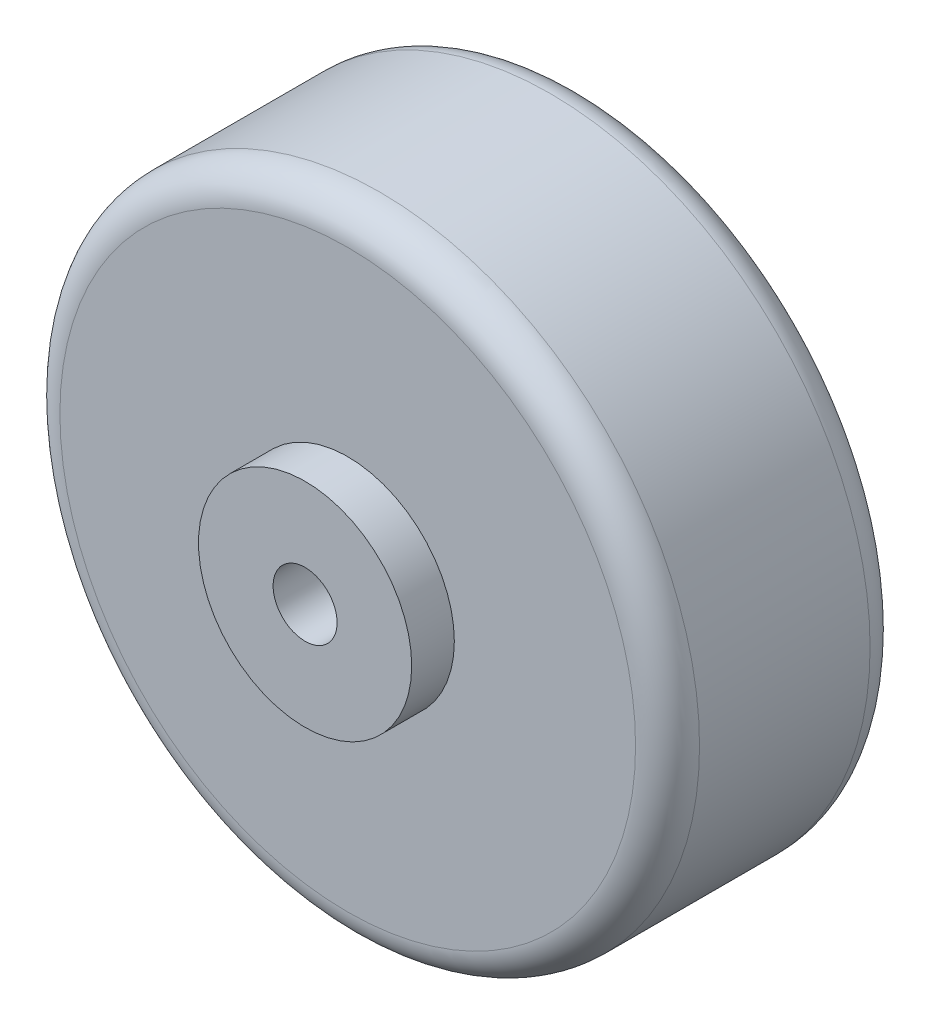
ISO-10303-21;
HEADER;
FILE_DESCRIPTION(('STEP AP214'),'2;1');
FILE_NAME('part.step','',(''),(''),'','','');
FILE_SCHEMA(('AUTOMOTIVE_DESIGN { 1 0 10303 214 1 1 1 1 }'));
ENDSEC;
DATA;
#1=APPLICATION_CONTEXT('core data for automotive mechanical design processes');
#2=APPLICATION_PROTOCOL_DEFINITION('international standard','automotive_design',2000,#1);
#3=PRODUCT_CONTEXT('',#1,'mechanical');
#4=PRODUCT('Part','Part','',(#3));
#5=PRODUCT_RELATED_PRODUCT_CATEGORY('part','',(#4));
#6=PRODUCT_DEFINITION_FORMATION('','',#4);
#7=PRODUCT_DEFINITION_CONTEXT('part definition',#1,'design');
#8=PRODUCT_DEFINITION('design','',#6,#7);
#9=PRODUCT_DEFINITION_SHAPE('','',#8);
#10=(LENGTH_UNIT() NAMED_UNIT(*) SI_UNIT(.MILLI.,.METRE.));
#11=(NAMED_UNIT(*) PLANE_ANGLE_UNIT() SI_UNIT($,.RADIAN.));
#12=(NAMED_UNIT(*) SI_UNIT($,.STERADIAN.) SOLID_ANGLE_UNIT());
#13=UNCERTAINTY_MEASURE_WITH_UNIT(LENGTH_MEASURE(1.E-05),#10,'distance_accuracy_value','');
#14=(GEOMETRIC_REPRESENTATION_CONTEXT(3) GLOBAL_UNCERTAINTY_ASSIGNED_CONTEXT((#13)) GLOBAL_UNIT_ASSIGNED_CONTEXT((#10,
#11,#12)) REPRESENTATION_CONTEXT('',''));
#15=CARTESIAN_POINT('',(0.,0.,0.));
#16=DIRECTION('',(0.,0.,1.));
#17=DIRECTION('',(1.,0.,0.));
#18=AXIS2_PLACEMENT_3D('',#15,#16,#17);
#19=CARTESIAN_POINT('',(0.,0.,-15.));
#20=DIRECTION('',(0.,0.,1.));
#21=DIRECTION('',(1.,0.,0.));
#22=AXIS2_PLACEMENT_3D('',#19,#20,#21);
#23=CYLINDRICAL_SURFACE('',#22,10.);
#24=CARTESIAN_POINT('',(0.,0.,-15.));
#25=DIRECTION('',(0.,0.,1.));
#26=DIRECTION('',(1.,0.,0.));
#27=AXIS2_PLACEMENT_3D('',#24,#25,#26);
#28=CIRCLE('',#27,10.);
#29=CARTESIAN_POINT('',(10.,0.,-15.));
#30=VERTEX_POINT('',#29);
#31=EDGE_CURVE('E10',#30,#30,#28,.T.);
#32=ORIENTED_EDGE('',*,*,#31,.T.);
#33=EDGE_LOOP('',(#32));
#34=FACE_BOUND('',#33,.T.);
#35=CARTESIAN_POINT('',(0.,0.,-11.));
#36=DIRECTION('',(0.,0.,1.));
#37=DIRECTION('',(1.,0.,0.));
#38=AXIS2_PLACEMENT_3D('',#35,#36,#37);
#39=CIRCLE('',#38,10.);
#40=CARTESIAN_POINT('',(10.,0.,-11.));
#41=VERTEX_POINT('',#40);
#42=EDGE_CURVE('E59',#41,#41,#39,.T.);
#43=ORIENTED_EDGE('',*,*,#42,.F.);
#44=EDGE_LOOP('',(#43));
#45=FACE_BOUND('',#44,.T.);
#46=ADVANCED_FACE('F31',(#34,#45),#23,.T.);
#47=CARTESIAN_POINT('',(10.,0.,-15.));
#48=DIRECTION('',(0.,0.,-1.));
#49=DIRECTION('',(-1.,0.,0.));
#50=AXIS2_PLACEMENT_3D('',#47,#48,#49);
#51=PLANE('',#50);
#52=CARTESIAN_POINT('',(0.,0.,-15.));
#53=DIRECTION('',(0.,0.,1.));
#54=DIRECTION('',(1.,0.,0.));
#55=AXIS2_PLACEMENT_3D('',#52,#53,#54);
#56=CIRCLE('',#55,3.);
#57=CARTESIAN_POINT('',(3.,0.,-15.));
#58=VERTEX_POINT('',#57);
#59=EDGE_CURVE('E62',#58,#58,#56,.T.);
#60=ORIENTED_EDGE('',*,*,#59,.T.);
#61=EDGE_LOOP('',(#60));
#62=FACE_BOUND('',#61,.T.);
#63=ORIENTED_EDGE('',*,*,#31,.F.);
#64=EDGE_LOOP('',(#63));
#65=FACE_BOUND('',#64,.T.);
#66=ADVANCED_FACE('F69',(#62,#65),#51,.T.);
#67=CARTESIAN_POINT('',(0.,0.,15.));
#68=DIRECTION('',(0.,0.,1.));
#69=DIRECTION('',(1.,0.,0.));
#70=AXIS2_PLACEMENT_3D('',#67,#68,#69);
#71=PLANE('',#70);
#72=CARTESIAN_POINT('',(0.,0.,15.));
#73=DIRECTION('',(0.,0.,1.));
#74=DIRECTION('',(1.,0.,0.));
#75=AXIS2_PLACEMENT_3D('',#72,#73,#74);
#76=CIRCLE('',#75,3.);
#77=CARTESIAN_POINT('',(3.,0.,15.));
#78=VERTEX_POINT('',#77);
#79=EDGE_CURVE('E63',#78,#78,#76,.T.);
#80=ORIENTED_EDGE('',*,*,#79,.F.);
#81=EDGE_LOOP('',(#80));
#82=FACE_BOUND('',#81,.T.);
#83=CARTESIAN_POINT('',(0.,0.,15.));
#84=DIRECTION('',(0.,0.,1.));
#85=DIRECTION('',(1.,0.,0.));
#86=AXIS2_PLACEMENT_3D('',#83,#84,#85);
#87=CIRCLE('',#86,10.);
#88=CARTESIAN_POINT('',(10.,0.,15.));
#89=VERTEX_POINT('',#88);
#90=EDGE_CURVE('E37',#89,#89,#87,.T.);
#91=ORIENTED_EDGE('',*,*,#90,.T.);
#92=EDGE_LOOP('',(#91));
#93=FACE_BOUND('',#92,.T.);
#94=ADVANCED_FACE('F79',(#82,#93),#71,.T.);
#95=CARTESIAN_POINT('',(0.,0.,-15.));
#96=DIRECTION('',(0.,0.,1.));
#97=DIRECTION('',(1.,0.,0.));
#98=AXIS2_PLACEMENT_3D('',#95,#96,#97);
#99=CYLINDRICAL_SURFACE('',#98,10.);
#100=CARTESIAN_POINT('',(0.,0.,11.));
#101=DIRECTION('',(0.,0.,1.));
#102=DIRECTION('',(1.,0.,0.));
#103=AXIS2_PLACEMENT_3D('',#100,#101,#102);
#104=CIRCLE('',#103,10.);
#105=CARTESIAN_POINT('',(10.,0.,11.));
#106=VERTEX_POINT('',#105);
#107=EDGE_CURVE('E41',#106,#106,#104,.T.);
#108=ORIENTED_EDGE('',*,*,#107,.T.);
#109=EDGE_LOOP('',(#108));
#110=FACE_BOUND('',#109,.T.);
#111=ORIENTED_EDGE('',*,*,#90,.F.);
#112=EDGE_LOOP('',(#111));
#113=FACE_BOUND('',#112,.T.);
#114=ADVANCED_FACE('F81',(#110,#113),#99,.T.);
#115=CARTESIAN_POINT('',(10.,0.,11.));
#116=DIRECTION('',(0.,0.,1.));
#117=DIRECTION('',(1.,0.,0.));
#118=AXIS2_PLACEMENT_3D('',#115,#116,#117);
#119=PLANE('',#118);
#120=CARTESIAN_POINT('',(0.,0.,11.));
#121=DIRECTION('',(0.,0.,1.));
#122=DIRECTION('',(1.,0.,0.));
#123=AXIS2_PLACEMENT_3D('',#120,#121,#122);
#124=CIRCLE('',#123,27.);
#125=CARTESIAN_POINT('',(27.,0.,11.));
#126=VERTEX_POINT('',#125);
#127=EDGE_CURVE('E45',#126,#126,#124,.T.);
#128=ORIENTED_EDGE('',*,*,#127,.T.);
#129=EDGE_LOOP('',(#128));
#130=FACE_BOUND('',#129,.T.);
#131=ORIENTED_EDGE('',*,*,#107,.F.);
#132=EDGE_LOOP('',(#131));
#133=FACE_BOUND('',#132,.T.);
#134=ADVANCED_FACE('F88',(#130,#133),#119,.T.);
#135=CARTESIAN_POINT('',(0.,0.,8.));
#136=DIRECTION('',(0.,0.,1.));
#137=DIRECTION('',(1.,0.,0.));
#138=AXIS2_PLACEMENT_3D('',#135,#136,#137);
#139=TOROIDAL_SURFACE('',#138,27.,3.);
#140=CARTESIAN_POINT('',(0.,0.,8.));
#141=DIRECTION('',(0.,0.,1.));
#142=DIRECTION('',(1.,0.,0.));
#143=AXIS2_PLACEMENT_3D('',#140,#141,#142);
#144=CIRCLE('',#143,30.);
#145=CARTESIAN_POINT('',(30.,0.,8.));
#146=VERTEX_POINT('',#145);
#147=EDGE_CURVE('E50',#146,#146,#144,.T.);
#148=ORIENTED_EDGE('',*,*,#147,.T.);
#149=EDGE_LOOP('',(#148));
#150=FACE_BOUND('',#149,.T.);
#151=ORIENTED_EDGE('',*,*,#127,.F.);
#152=EDGE_LOOP('',(#151));
#153=FACE_BOUND('',#152,.T.);
#154=ADVANCED_FACE('F112',(#150,#153),#139,.T.);
#155=CARTESIAN_POINT('',(0.,0.,-15.));
#156=DIRECTION('',(0.,0.,1.));
#157=DIRECTION('',(1.,0.,0.));
#158=AXIS2_PLACEMENT_3D('',#155,#156,#157);
#159=CYLINDRICAL_SURFACE('',#158,30.);
#160=CARTESIAN_POINT('',(0.,0.,-8.));
#161=DIRECTION('',(0.,0.,1.));
#162=DIRECTION('',(1.,0.,0.));
#163=AXIS2_PLACEMENT_3D('',#160,#161,#162);
#164=CIRCLE('',#163,30.);
#165=CARTESIAN_POINT('',(30.,0.,-8.));
#166=VERTEX_POINT('',#165);
#167=EDGE_CURVE('E53',#166,#166,#164,.T.);
#168=ORIENTED_EDGE('',*,*,#167,.T.);
#169=EDGE_LOOP('',(#168));
#170=FACE_BOUND('',#169,.T.);
#171=ORIENTED_EDGE('',*,*,#147,.F.);
#172=EDGE_LOOP('',(#171));
#173=FACE_BOUND('',#172,.T.);
#174=ADVANCED_FACE('F106',(#170,#173),#159,.T.);
#175=CARTESIAN_POINT('',(0.,0.,-8.));
#176=DIRECTION('',(0.,0.,1.));
#177=DIRECTION('',(1.,0.,0.));
#178=AXIS2_PLACEMENT_3D('',#175,#176,#177);
#179=TOROIDAL_SURFACE('',#178,27.,3.);
#180=CARTESIAN_POINT('',(0.,0.,-11.));
#181=DIRECTION('',(0.,0.,1.));
#182=DIRECTION('',(1.,0.,0.));
#183=AXIS2_PLACEMENT_3D('',#180,#181,#182);
#184=CIRCLE('',#183,27.);
#185=CARTESIAN_POINT('',(27.,0.,-11.));
#186=VERTEX_POINT('',#185);
#187=EDGE_CURVE('E56',#186,#186,#184,.T.);
#188=ORIENTED_EDGE('',*,*,#187,.T.);
#189=EDGE_LOOP('',(#188));
#190=FACE_BOUND('',#189,.T.);
#191=ORIENTED_EDGE('',*,*,#167,.F.);
#192=EDGE_LOOP('',(#191));
#193=FACE_BOUND('',#192,.T.);
#194=ADVANCED_FACE('F100',(#190,#193),#179,.T.);
#195=CARTESIAN_POINT('',(27.,0.,-11.));
#196=DIRECTION('',(0.,0.,-1.));
#197=DIRECTION('',(-1.,0.,0.));
#198=AXIS2_PLACEMENT_3D('',#195,#196,#197);
#199=PLANE('',#198);
#200=ORIENTED_EDGE('',*,*,#42,.T.);
#201=EDGE_LOOP('',(#200));
#202=FACE_BOUND('',#201,.T.);
#203=ORIENTED_EDGE('',*,*,#187,.F.);
#204=EDGE_LOOP('',(#203));
#205=FACE_BOUND('',#204,.T.);
#206=ADVANCED_FACE('F75',(#202,#205),#199,.T.);
#207=CARTESIAN_POINT('',(0.,0.,-15.));
#208=DIRECTION('',(0.,0.,1.));
#209=DIRECTION('',(1.,0.,0.));
#210=AXIS2_PLACEMENT_3D('',#207,#208,#209);
#211=CYLINDRICAL_SURFACE('',#210,3.);
#212=ORIENTED_EDGE('',*,*,#59,.F.);
#213=EDGE_LOOP('',(#212));
#214=FACE_BOUND('',#213,.T.);
#215=ORIENTED_EDGE('',*,*,#79,.T.);
#216=EDGE_LOOP('',(#215));
#217=FACE_BOUND('',#216,.T.);
#218=ADVANCED_FACE('F72',(#214,#217),#211,.F.);
#219=CLOSED_SHELL('',(#46,#66,#94,#114,#134,#154,#174,#194,#206,#218));
#220=MANIFOLD_SOLID_BREP('B2',#219);
#221=ADVANCED_BREP_SHAPE_REPRESENTATION('',(#18,#220),#14);
#222=SHAPE_DEFINITION_REPRESENTATION(#9,#221);
ENDSEC;
END-ISO-10303-21;
